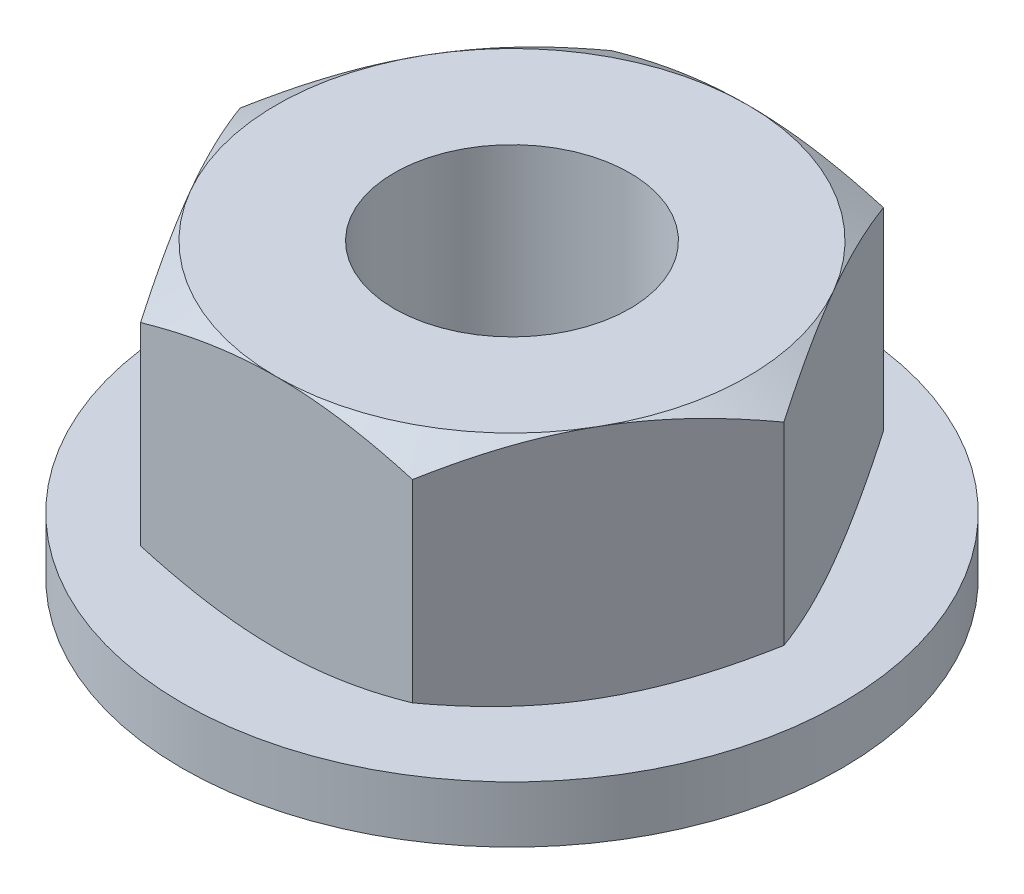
from build123d import *

# Parameters (mm, degrees)
EXTRUSION1_DEPTH        = 2.5
ESQUISSE3_R             = 2.5
ENL_V_MAT_EXTRU_1_DEPTH = 10.128709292
ESQUISSE4_W             = 3.5
ESQUISSE4_H             = 1.2


with BuildPart() as part:
    # Esquisse1 → Extrusion1 (new, symmetric)
    with BuildSketch(Plane(origin=(0, 0, 0), x_dir=(1, 0, 0), z_dir=(0, 1, 0))):
        Polygon((5.773502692, 0), (2.886751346, 5), (-2.886751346, 5), (-5.773502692, 0), (-2.886751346, -5), (2.886751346, -5), align=None)
    extrude(amount=EXTRUSION1_DEPTH, both=True)

    # Esquisse2 → Enl_vement de mati_re-R_volution4 (revolve, cut)
    with BuildSketch(Plane(origin=(0, 0, 0), x_dir=(0, 0, -1), z_dir=(1, 0, 0))):
        Polygon((2, 4.232050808), (8, 4.232050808), (8, 0.767949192), align=None)
    enl_vement_de_mati_re_r_volution4 = revolve(axis=Axis((0, 9.378046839, 0), (0, -1, 0)), mode=Mode.SUBTRACT)

    # Sym_trie1: Enl_vement de mati_re-R_volution4 across plane
    add(enl_vement_de_mati_re_r_volution4.mirror(Plane.ZX), mode=Mode.SUBTRACT)

    # Esquisse3 → Enl_v. mat.-Extru.1 (cut, through all)
    with BuildSketch(Plane(origin=(0, 2.5, 0), x_dir=(-1, 0, 0), z_dir=(0, 1, 0))):
        with Locations(Location((0, 0, 0), (0, 0, 90))):
            Circle(ESQUISSE3_R)
    extrude(amount=-ENL_V_MAT_EXTRU_1_DEPTH, mode=Mode.SUBTRACT)

    # Esquisse4 → R_volution1 (revolve)
    with BuildSketch(Plane.XY, mode=Mode.PRIVATE) as r_volution1_sk:
        with Locations((5.25, -3.1)):
            Rectangle(ESQUISSE4_W, ESQUISSE4_H)
    revolve(r_volution1_sk.sketch.rotate(Axis((0, 0, 0), (0, -1, 0)), 90), axis=Axis((0, 0, 0), (0, -1, 0)))


solid = part.part
